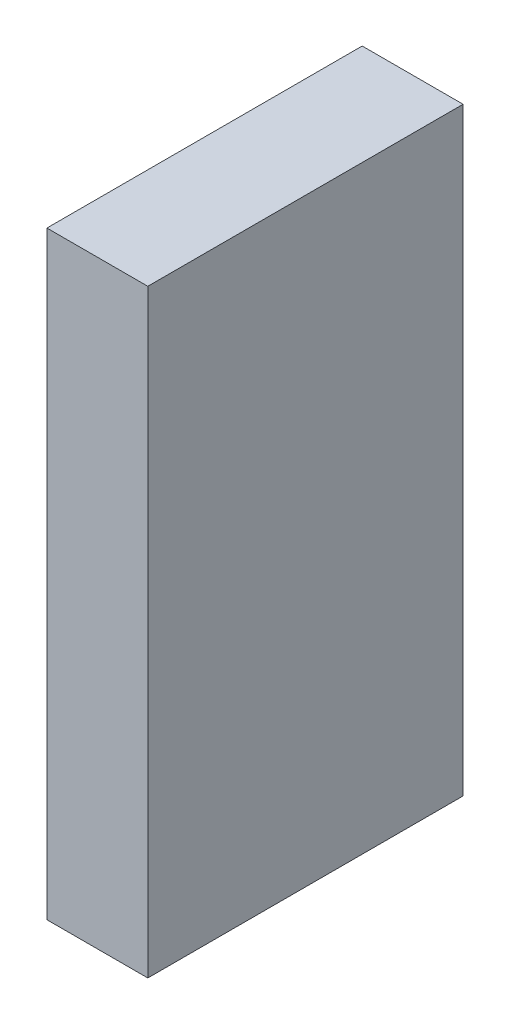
from build123d import *

# Parameters (mm, degrees)
ESQUISSE1_W      = 8
ESQUISSE1_H      = 47.5
EXTRUSION1_DEPTH = 25


with BuildPart() as part:
    # Esquisse1 → Extrusion1 (new body)
    with BuildSketch(Plane.XY):
        with Locations((4, 23.75)):
            Rectangle(ESQUISSE1_W, ESQUISSE1_H)
    extrude(amount=EXTRUSION1_DEPTH)


solid = part.part
